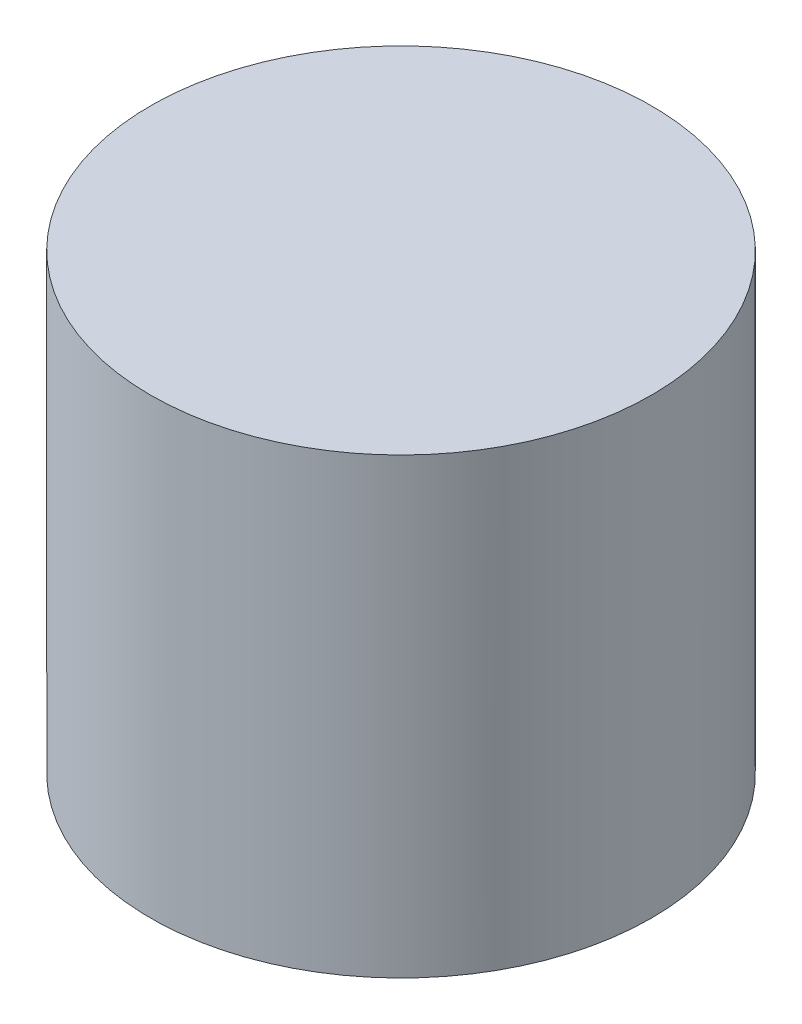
ISO-10303-21;
HEADER;
FILE_DESCRIPTION(('STEP AP214'),'2;1');
FILE_NAME('part.step','',(''),(''),'','','');
FILE_SCHEMA(('AUTOMOTIVE_DESIGN { 1 0 10303 214 1 1 1 1 }'));
ENDSEC;
DATA;
#1=APPLICATION_CONTEXT('core data for automotive mechanical design processes');
#2=APPLICATION_PROTOCOL_DEFINITION('international standard','automotive_design',2000,#1);
#3=PRODUCT_CONTEXT('',#1,'mechanical');
#4=PRODUCT('Part','Part','',(#3));
#5=PRODUCT_RELATED_PRODUCT_CATEGORY('part','',(#4));
#6=PRODUCT_DEFINITION_FORMATION('','',#4);
#7=PRODUCT_DEFINITION_CONTEXT('part definition',#1,'design');
#8=PRODUCT_DEFINITION('design','',#6,#7);
#9=PRODUCT_DEFINITION_SHAPE('','',#8);
#10=(LENGTH_UNIT() NAMED_UNIT(*) SI_UNIT(.MILLI.,.METRE.));
#11=(NAMED_UNIT(*) PLANE_ANGLE_UNIT() SI_UNIT($,.RADIAN.));
#12=(NAMED_UNIT(*) SI_UNIT($,.STERADIAN.) SOLID_ANGLE_UNIT());
#13=UNCERTAINTY_MEASURE_WITH_UNIT(LENGTH_MEASURE(1.E-05),#10,'distance_accuracy_value','');
#14=(GEOMETRIC_REPRESENTATION_CONTEXT(3) GLOBAL_UNCERTAINTY_ASSIGNED_CONTEXT((#13)) GLOBAL_UNIT_ASSIGNED_CONTEXT((#10,
#11,#12)) REPRESENTATION_CONTEXT('',''));
#15=CARTESIAN_POINT('',(0.,0.,0.));
#16=DIRECTION('',(0.,0.,1.));
#17=DIRECTION('',(1.,0.,0.));
#18=AXIS2_PLACEMENT_3D('',#15,#16,#17);
#19=CARTESIAN_POINT('',(0.,57.4,0.));
#20=DIRECTION('',(0.,-1.,0.));
#21=DIRECTION('',(0.,0.,-1.));
#22=AXIS2_PLACEMENT_3D('',#19,#20,#21);
#23=CYLINDRICAL_SURFACE('',#22,31.75);
#24=CARTESIAN_POINT('',(0.,57.4,0.));
#25=DIRECTION('',(0.,1.,0.));
#26=DIRECTION('',(0.,0.,1.));
#27=AXIS2_PLACEMENT_3D('',#24,#25,#26);
#28=CIRCLE('',#27,31.75);
#29=CARTESIAN_POINT('',(0.,57.4,31.75));
#30=VERTEX_POINT('',#29);
#31=EDGE_CURVE('E221',#30,#30,#28,.T.);
#32=ORIENTED_EDGE('',*,*,#31,.F.);
#33=EDGE_LOOP('',(#32));
#34=FACE_BOUND('',#33,.T.);
#35=DIRECTION('',(0.,-1.,0.));
#36=VECTOR('',#35,1.);
#37=CARTESIAN_POINT('',(14.6000295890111,57.4,-28.194));
#38=LINE('',#37,#36);
#39=CARTESIAN_POINT('',(14.6000295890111,21.59,-28.194));
#40=VERTEX_POINT('',#39);
#41=CARTESIAN_POINT('',(14.6000295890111,0.,-28.194));
#42=VERTEX_POINT('',#41);
#43=EDGE_CURVE('E64',#40,#42,#38,.T.);
#44=ORIENTED_EDGE('',*,*,#43,.F.);
#45=CARTESIAN_POINT('',(0.,21.59,0.));
#46=DIRECTION('',(0.,1.,0.));
#47=DIRECTION('',(0.,0.,1.));
#48=AXIS2_PLACEMENT_3D('',#45,#46,#47);
#49=CIRCLE('',#48,31.75);
#50=CARTESIAN_POINT('',(-14.6000295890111,21.59,-28.194));
#51=VERTEX_POINT('',#50);
#52=EDGE_CURVE('E175',#40,#51,#49,.T.);
#53=ORIENTED_EDGE('',*,*,#52,.T.);
#54=DIRECTION('',(0.,-1.,0.));
#55=VECTOR('',#54,1.);
#56=CARTESIAN_POINT('',(-14.6000295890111,57.4,-28.194));
#57=LINE('',#56,#55);
#58=CARTESIAN_POINT('',(-14.6000295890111,0.,-28.194));
#59=VERTEX_POINT('',#58);
#60=EDGE_CURVE('E228',#59,#51,#57,.F.);
#61=ORIENTED_EDGE('',*,*,#60,.F.);
#62=CARTESIAN_POINT('',(0.,0.,0.));
#63=DIRECTION('',(0.,1.,0.));
#64=DIRECTION('',(0.,0.,1.));
#65=AXIS2_PLACEMENT_3D('',#62,#63,#64);
#66=CIRCLE('',#65,31.75);
#67=EDGE_CURVE('E226',#59,#42,#66,.T.);
#68=ORIENTED_EDGE('',*,*,#67,.T.);
#69=EDGE_LOOP('',(#44,#53,#61,#68));
#70=FACE_BOUND('',#69,.T.);
#71=ADVANCED_FACE('F37',(#34,#70),#23,.T.);
#72=CARTESIAN_POINT('',(0.,0.,0.));
#73=DIRECTION('',(0.,1.,0.));
#74=DIRECTION('',(0.,0.,1.));
#75=AXIS2_PLACEMENT_3D('',#72,#73,#74);
#76=PLANE('',#75);
#77=CARTESIAN_POINT('',(-17.5,0.,0.));
#78=DIRECTION('',(0.,-1.,0.));
#79=DIRECTION('',(0.,0.,-1.));
#80=AXIS2_PLACEMENT_3D('',#77,#78,#79);
#81=CIRCLE('',#80,2.5);
#82=CARTESIAN_POINT('',(-17.5,0.,-2.5));
#83=VERTEX_POINT('',#82);
#84=EDGE_CURVE('E116',#83,#83,#81,.T.);
#85=ORIENTED_EDGE('',*,*,#84,.F.);
#86=EDGE_LOOP('',(#85));
#87=FACE_BOUND('',#86,.T.);
#88=CARTESIAN_POINT('',(17.5,0.,0.));
#89=DIRECTION('',(0.,-1.,0.));
#90=DIRECTION('',(0.,0.,-1.));
#91=AXIS2_PLACEMENT_3D('',#88,#89,#90);
#92=CIRCLE('',#91,2.5);
#93=CARTESIAN_POINT('',(17.5,0.,-2.5));
#94=VERTEX_POINT('',#93);
#95=EDGE_CURVE('E115',#94,#94,#92,.T.);
#96=ORIENTED_EDGE('',*,*,#95,.F.);
#97=EDGE_LOOP('',(#96));
#98=FACE_BOUND('',#97,.T.);
#99=CARTESIAN_POINT('',(0.,0.,-17.5));
#100=DIRECTION('',(0.,-1.,0.));
#101=DIRECTION('',(0.,0.,-1.));
#102=AXIS2_PLACEMENT_3D('',#99,#100,#101);
#103=CIRCLE('',#102,2.5);
#104=CARTESIAN_POINT('',(0.,0.,-20.));
#105=VERTEX_POINT('',#104);
#106=EDGE_CURVE('E245',#105,#105,#103,.T.);
#107=ORIENTED_EDGE('',*,*,#106,.F.);
#108=EDGE_LOOP('',(#107));
#109=FACE_BOUND('',#108,.T.);
#110=CARTESIAN_POINT('',(-15.1554445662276,0.,8.75000000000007));
#111=DIRECTION('',(0.,-1.,0.));
#112=DIRECTION('',(0.,0.,-1.));
#113=AXIS2_PLACEMENT_3D('',#110,#111,#112);
#114=CIRCLE('',#113,2.5);
#115=CARTESIAN_POINT('',(-15.1554445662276,0.,6.25000000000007));
#116=VERTEX_POINT('',#115);
#117=EDGE_CURVE('E239',#116,#116,#114,.T.);
#118=ORIENTED_EDGE('',*,*,#117,.F.);
#119=EDGE_LOOP('',(#118));
#120=FACE_BOUND('',#119,.T.);
#121=CARTESIAN_POINT('',(15.1554445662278,0.,8.74999999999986));
#122=DIRECTION('',(0.,-1.,0.));
#123=DIRECTION('',(0.,0.,-1.));
#124=AXIS2_PLACEMENT_3D('',#121,#122,#123);
#125=CIRCLE('',#124,2.5);
#126=CARTESIAN_POINT('',(15.1554445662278,0.,6.24999999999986));
#127=VERTEX_POINT('',#126);
#128=EDGE_CURVE('E231',#127,#127,#125,.T.);
#129=ORIENTED_EDGE('',*,*,#128,.F.);
#130=EDGE_LOOP('',(#129));
#131=FACE_BOUND('',#130,.T.);
#132=DIRECTION('',(-1.,0.,0.));
#133=VECTOR('',#132,1.);
#134=CARTESIAN_POINT('',(0.,0.,-28.194));
#135=LINE('',#134,#133);
#136=EDGE_CURVE('E249',#42,#59,#135,.T.);
#137=ORIENTED_EDGE('',*,*,#136,.F.);
#138=ORIENTED_EDGE('',*,*,#67,.F.);
#139=EDGE_LOOP('',(#137,#138));
#140=FACE_BOUND('',#139,.T.);
#141=ADVANCED_FACE('F211',(#87,#98,#109,#120,#131,#140),#76,.F.);
#142=CARTESIAN_POINT('',(0.,57.4,0.));
#143=DIRECTION('',(0.,1.,0.));
#144=DIRECTION('',(0.,0.,1.));
#145=AXIS2_PLACEMENT_3D('',#142,#143,#144);
#146=PLANE('',#145);
#147=ORIENTED_EDGE('',*,*,#31,.T.);
#148=EDGE_LOOP('',(#147));
#149=FACE_BOUND('',#148,.T.);
#150=ADVANCED_FACE('F216',(#149),#146,.T.);
#151=CARTESIAN_POINT('',(0.,0.,-17.5));
#152=DIRECTION('',(0.,-1.,0.));
#153=DIRECTION('',(0.,0.,-1.));
#154=AXIS2_PLACEMENT_3D('',#151,#152,#153);
#155=CYLINDRICAL_SURFACE('',#154,2.5);
#156=CARTESIAN_POINT('',(0.,12.7,-17.5));
#157=DIRECTION('',(0.,-1.,0.));
#158=DIRECTION('',(0.,0.,-1.));
#159=AXIS2_PLACEMENT_3D('',#156,#157,#158);
#160=CIRCLE('',#159,2.5);
#161=CARTESIAN_POINT('',(0.883727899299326,12.7,-19.8385946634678));
#162=VERTEX_POINT('',#161);
#163=CARTESIAN_POINT('',(-0.883727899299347,12.7,-19.8385946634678));
#164=VERTEX_POINT('',#163);
#165=EDGE_CURVE('E242',#162,#164,#160,.T.);
#166=ORIENTED_EDGE('',*,*,#165,.F.);
#167=CARTESIAN_POINT('',(0.883727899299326,12.7,-19.8385946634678));
#168=CARTESIAN_POINT('',(0.842606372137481,12.6809250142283,-19.8541341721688));
#169=CARTESIAN_POINT('',(0.800595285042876,12.6630545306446,-19.8687684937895));
#170=CARTESIAN_POINT('',(0.71489933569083,12.6298960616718,-19.8960269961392));
#171=CARTESIAN_POINT('',(0.671213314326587,12.6146099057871,-19.9086497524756));
#172=CARTESIAN_POINT('',(0.537797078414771,12.5728974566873,-19.9431935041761));
#173=CARTESIAN_POINT('',(0.445795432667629,12.5506579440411,-19.9617565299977));
#174=CARTESIAN_POINT('',(0.257761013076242,12.5186889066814,-19.9884968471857));
#175=CARTESIAN_POINT('',(0.161712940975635,12.5090122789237,-19.9966302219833));
#176=CARTESIAN_POINT('',(-0.0309609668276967,12.5030234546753,-20.0016598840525));
#177=CARTESIAN_POINT('',(-0.127585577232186,12.5066890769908,-19.9985748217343));
#178=CARTESIAN_POINT('',(-0.313202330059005,12.526502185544,-19.9819603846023));
#179=CARTESIAN_POINT('',(-0.402323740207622,12.5419598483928,-19.9690082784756));
#180=CARTESIAN_POINT('',(-0.576238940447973,12.5836289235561,-19.9342982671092));
#181=CARTESIAN_POINT('',(-0.661032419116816,12.6098411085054,-19.9125397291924));
#182=CARTESIAN_POINT('',(-0.766827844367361,12.6498425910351,-19.8796248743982));
#183=CARTESIAN_POINT('',(-0.790618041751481,12.6593441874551,-19.8718230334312));
#184=CARTESIAN_POINT('',(-0.837604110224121,12.6791066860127,-19.8556385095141));
#185=CARTESIAN_POINT('',(-0.860801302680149,12.6893656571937,-19.8472573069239));
#186=CARTESIAN_POINT('',(-0.883727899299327,12.7,-19.8385946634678));
#187=B_SPLINE_CURVE_WITH_KNOTS('',3,(#167,#168,#169,#170,#171,#172,#173,#174,#175,#176,#177,
#178,#179,#180,#181,#182,#183,#184,#185,#186),.UNSPECIFIED.,.F.,.F.,(4,2,2,2,2,2,2,2,2,4),(0.,
0.143700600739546,0.287502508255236,0.575407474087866,0.864520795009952,1.15315369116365,
1.42608580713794,1.6990375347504,1.77936126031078,1.85948683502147),.UNSPECIFIED.);
#188=EDGE_CURVE('E142',#162,#164,#187,.T.);
#189=ORIENTED_EDGE('',*,*,#188,.T.);
#190=EDGE_LOOP('',(#166,#189));
#191=FACE_BOUND('',#190,.T.);
#192=ORIENTED_EDGE('',*,*,#106,.T.);
#193=EDGE_LOOP('',(#192));
#194=FACE_BOUND('',#193,.T.);
#195=ADVANCED_FACE('F151',(#191,#194),#155,.F.);
#196=CARTESIAN_POINT('',(0.,12.7,-17.5));
#197=DIRECTION('',(0.,-1.,0.));
#198=DIRECTION('',(0.,0.,-1.));
#199=AXIS2_PLACEMENT_3D('',#196,#197,#198);
#200=CONICAL_SURFACE('',#199,2.5,1.02974425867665);
#201=CARTESIAN_POINT('',(0.,14.2021515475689,-17.5));
#202=VERTEX_POINT('',#201);
#203=VERTEX_LOOP('',#202);
#204=FACE_BOUND('',#203,.T.);
#205=CARTESIAN_POINT('',(-0.905817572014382,12.7100349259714,-19.8122));
#206=CARTESIAN_POINT('',(-0.866776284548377,12.7304115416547,-19.7910520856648));
#207=CARTESIAN_POINT('',(-0.827303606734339,12.7504018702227,-19.7702718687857));
#208=CARTESIAN_POINT('',(-0.747053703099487,12.789301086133,-19.729773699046));
#209=CARTESIAN_POINT('',(-0.706271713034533,12.8082051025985,-19.7100605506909));
#210=CARTESIAN_POINT('',(-0.621828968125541,12.8450809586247,-19.6715438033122));
#211=CARTESIAN_POINT('',(-0.5781174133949,12.8629969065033,-19.6527962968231));
#212=CARTESIAN_POINT('',(-0.488884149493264,12.8964068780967,-19.6177780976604));
#213=CARTESIAN_POINT('',(-0.443365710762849,12.9119050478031,-19.6015031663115));
#214=CARTESIAN_POINT('',(-0.346551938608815,12.9405512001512,-19.5713775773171));
#215=CARTESIAN_POINT('',(-0.295081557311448,12.9534267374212,-19.5578096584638));
#216=CARTESIAN_POINT('',(-0.190276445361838,12.97339282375,-19.5367492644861));
#217=CARTESIAN_POINT('',(-0.136966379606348,12.980541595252,-19.5291956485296));
#218=CARTESIAN_POINT('',(-0.0285596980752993,12.9878303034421,-19.521494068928));
#219=CARTESIAN_POINT('',(0.0265511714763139,12.9878772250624,-19.5214443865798));
#220=CARTESIAN_POINT('',(0.135883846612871,12.9807002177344,-19.5290281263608));
#221=CARTESIAN_POINT('',(0.190101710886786,12.9734499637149,-19.5366893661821));
#222=CARTESIAN_POINT('',(0.317142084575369,12.9491900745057,-19.562278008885));
#223=CARTESIAN_POINT('',(0.388807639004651,12.9294490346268,-19.5830732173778));
#224=CARTESIAN_POINT('',(0.52762454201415,12.8832634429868,-19.6315741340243));
#225=CARTESIAN_POINT('',(0.594748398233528,12.8567820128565,-19.6593178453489));
#226=CARTESIAN_POINT('',(0.702581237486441,12.8098904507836,-19.7083027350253));
#227=CARTESIAN_POINT('',(0.744314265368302,12.7905984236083,-19.728422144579));
#228=CARTESIAN_POINT('',(0.826110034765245,12.7510087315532,-19.7696409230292));
#229=CARTESIAN_POINT('',(0.866186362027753,12.7307249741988,-19.7907265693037));
#230=CARTESIAN_POINT('',(0.905817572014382,12.7100349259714,-19.8122));
#231=B_SPLINE_CURVE_WITH_KNOTS('',3,(#205,#206,#207,#208,#209,#210,#211,#212,#213,#214,#215,
#216,#217,#218,#219,#220,#221,#222,#223,#224,#225,#226,#227,#228,#229,#230),.UNSPECIFIED.,.F.,
.F.,(4,2,2,2,2,2,2,2,2,2,2,2,4),(0.,0.146592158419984,0.29379720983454,0.446161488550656,
0.598261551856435,0.762060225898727,0.924171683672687,1.08840618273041,1.25323530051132,
1.48348657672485,1.7150257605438,1.86554324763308,2.01435149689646),.UNSPECIFIED.);
#232=CARTESIAN_POINT('',(-0.905448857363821,12.7102276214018,-19.812));
#233=VERTEX_POINT('',#232);
#234=CARTESIAN_POINT('',(0.90544885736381,12.7102276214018,-19.812));
#235=VERTEX_POINT('',#234);
#236=EDGE_CURVE('E49',#233,#235,#231,.T.);
#237=ORIENTED_EDGE('',*,*,#236,.T.);
#238=CARTESIAN_POINT('',(0.930031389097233,12.7221719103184,-19.7807678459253));
#239=CARTESIAN_POINT('',(0.926876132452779,12.7206135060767,-19.7848553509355));
#240=CARTESIAN_POINT('',(0.923705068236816,12.7190569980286,-19.7889328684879));
#241=CARTESIAN_POINT('',(0.857500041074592,12.6867664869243,-19.8734213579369));
#242=CARTESIAN_POINT('',(0.78825248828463,12.6568506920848,-19.9497818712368));
#243=CARTESIAN_POINT('',(0.680303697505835,12.6179676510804,-20.0475265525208));
#244=CARTESIAN_POINT('',(0.647576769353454,12.6070240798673,-20.0748399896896));
#245=CARTESIAN_POINT('',(0.579547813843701,12.5862402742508,-20.1264296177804));
#246=CARTESIAN_POINT('',(0.544250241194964,12.5763982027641,-20.150710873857));
#247=CARTESIAN_POINT('',(0.465570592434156,12.5568027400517,-20.1988440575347));
#248=CARTESIAN_POINT('',(0.421762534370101,12.5472746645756,-20.2221091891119));
#249=CARTESIAN_POINT('',(0.330620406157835,12.5306652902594,-20.2625232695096));
#250=CARTESIAN_POINT('',(0.283263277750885,12.5236020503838,-20.2796271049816));
#251=CARTESIAN_POINT('',(0.234463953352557,12.518129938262,-20.2928581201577));
#252=B_SPLINE_CURVE_WITH_KNOTS('',3,(#238,#239,#240,#241,#242,#243,#244,#245,#246,#247,#248,
#249,#250,#251),.UNSPECIFIED.,.F.,.F.,(4,2,2,2,2,2,4),(0.,0.0161842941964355,0.336204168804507,
0.468092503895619,0.59975749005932,0.750759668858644,0.902846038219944),.UNSPECIFIED.);
#253=EDGE_CURVE('E11',#235,#162,#252,.T.);
#254=ORIENTED_EDGE('',*,*,#253,.T.);
#255=ORIENTED_EDGE('',*,*,#165,.T.);
#256=CARTESIAN_POINT('',(-0.234463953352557,12.518129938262,-20.2928581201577));
#257=CARTESIAN_POINT('',(-0.283263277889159,12.5236020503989,-20.2796271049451));
#258=CARTESIAN_POINT('',(-0.330620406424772,12.5306652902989,-20.2625232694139));
#259=CARTESIAN_POINT('',(-0.421762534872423,12.5472746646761,-20.2221091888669));
#260=CARTESIAN_POINT('',(-0.465570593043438,12.5568027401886,-20.1988440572));
#261=CARTESIAN_POINT('',(-0.544250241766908,12.5763982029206,-20.1507108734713));
#262=CARTESIAN_POINT('',(-0.579547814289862,12.5862402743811,-20.1264296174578));
#263=CARTESIAN_POINT('',(-0.647576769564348,12.6070240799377,-20.0748399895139));
#264=CARTESIAN_POINT('',(-0.680303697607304,12.6179676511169,-20.047526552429));
#265=CARTESIAN_POINT('',(-0.78825248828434,12.6568506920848,-19.9497818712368));
#266=CARTESIAN_POINT('',(-0.857500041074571,12.6867664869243,-19.8734213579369));
#267=CARTESIAN_POINT('',(-0.923705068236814,12.7190569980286,-19.7889328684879));
#268=CARTESIAN_POINT('',(-0.926876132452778,12.7206135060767,-19.7848553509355));
#269=CARTESIAN_POINT('',(-0.930031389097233,12.7221719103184,-19.7807678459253));
#270=B_SPLINE_CURVE_WITH_KNOTS('',3,(#256,#257,#258,#259,#260,#261,#262,#263,#264,#265,#266,
#267,#268,#269),.UNSPECIFIED.,.F.,.F.,(4,2,2,2,2,2,4),(0.,0.152086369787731,0.303088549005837,
0.43475353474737,0.56664186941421,0.886661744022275,0.902846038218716),.UNSPECIFIED.);
#271=EDGE_CURVE('E169',#164,#233,#270,.T.);
#272=ORIENTED_EDGE('',*,*,#271,.T.);
#273=EDGE_LOOP('',(#237,#254,#255,#272));
#274=FACE_BOUND('',#273,.T.);
#275=ADVANCED_FACE('F180',(#204,#274),#200,.F.);
#276=CARTESIAN_POINT('',(-15.1554445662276,0.,8.75000000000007));
#277=DIRECTION('',(0.,-1.,0.));
#278=DIRECTION('',(0.,0.,-1.));
#279=AXIS2_PLACEMENT_3D('',#276,#277,#278);
#280=CYLINDRICAL_SURFACE('',#279,2.5);
#281=CARTESIAN_POINT('',(-15.1554445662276,12.7,8.75000000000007));
#282=DIRECTION('',(0.,-1.,0.));
#283=DIRECTION('',(0.,0.,-1.));
#284=AXIS2_PLACEMENT_3D('',#281,#282,#283);
#285=CIRCLE('',#284,2.5);
#286=CARTESIAN_POINT('',(-15.1554445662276,12.7,6.25000000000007));
#287=VERTEX_POINT('',#286);
#288=EDGE_CURVE('E236',#287,#287,#285,.T.);
#289=ORIENTED_EDGE('',*,*,#288,.F.);
#290=EDGE_LOOP('',(#289));
#291=FACE_BOUND('',#290,.T.);
#292=ORIENTED_EDGE('',*,*,#117,.T.);
#293=EDGE_LOOP('',(#292));
#294=FACE_BOUND('',#293,.T.);
#295=ADVANCED_FACE('F184',(#291,#294),#280,.F.);
#296=CARTESIAN_POINT('',(-15.1554445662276,12.7,8.75000000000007));
#297=DIRECTION('',(0.,-1.,0.));
#298=DIRECTION('',(0.,0.,-1.));
#299=AXIS2_PLACEMENT_3D('',#296,#297,#298);
#300=CONICAL_SURFACE('',#299,2.5,1.02974425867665);
#301=CARTESIAN_POINT('',(-15.1554445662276,14.2021515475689,8.75000000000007));
#302=VERTEX_POINT('',#301);
#303=VERTEX_LOOP('',#302);
#304=FACE_BOUND('',#303,.T.);
#305=ORIENTED_EDGE('',*,*,#288,.T.);
#306=EDGE_LOOP('',(#305));
#307=FACE_BOUND('',#306,.T.);
#308=ADVANCED_FACE('F190',(#304,#307),#300,.F.);
#309=CARTESIAN_POINT('',(15.1554445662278,0.,8.74999999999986));
#310=DIRECTION('',(0.,-1.,0.));
#311=DIRECTION('',(0.,0.,-1.));
#312=AXIS2_PLACEMENT_3D('',#309,#310,#311);
#313=CYLINDRICAL_SURFACE('',#312,2.5);
#314=CARTESIAN_POINT('',(15.1554445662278,12.7,8.74999999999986));
#315=DIRECTION('',(0.,-1.,0.));
#316=DIRECTION('',(0.,0.,-1.));
#317=AXIS2_PLACEMENT_3D('',#314,#315,#316);
#318=CIRCLE('',#317,2.5);
#319=CARTESIAN_POINT('',(15.1554445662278,12.7,6.24999999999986));
#320=VERTEX_POINT('',#319);
#321=EDGE_CURVE('E227',#320,#320,#318,.T.);
#322=ORIENTED_EDGE('',*,*,#321,.F.);
#323=EDGE_LOOP('',(#322));
#324=FACE_BOUND('',#323,.T.);
#325=ORIENTED_EDGE('',*,*,#128,.T.);
#326=EDGE_LOOP('',(#325));
#327=FACE_BOUND('',#326,.T.);
#328=ADVANCED_FACE('F194',(#324,#327),#313,.F.);
#329=CARTESIAN_POINT('',(15.1554445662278,12.7,8.74999999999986));
#330=DIRECTION('',(0.,-1.,0.));
#331=DIRECTION('',(0.,0.,-1.));
#332=AXIS2_PLACEMENT_3D('',#329,#330,#331);
#333=CONICAL_SURFACE('',#332,2.5,1.02974425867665);
#334=CARTESIAN_POINT('',(15.1554445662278,14.2021515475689,8.74999999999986));
#335=VERTEX_POINT('',#334);
#336=VERTEX_LOOP('',#335);
#337=FACE_BOUND('',#336,.T.);
#338=ORIENTED_EDGE('',*,*,#321,.T.);
#339=EDGE_LOOP('',(#338));
#340=FACE_BOUND('',#339,.T.);
#341=ADVANCED_FACE('F198',(#337,#340),#333,.F.);
#342=CARTESIAN_POINT('',(20.2530517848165,21.59,-31.75));
#343=DIRECTION('',(0.,1.,0.));
#344=DIRECTION('',(0.,0.,1.));
#345=AXIS2_PLACEMENT_3D('',#342,#343,#344);
#346=PLANE('',#345);
#347=DIRECTION('',(-1.,0.,0.));
#348=VECTOR('',#347,1.);
#349=CARTESIAN_POINT('',(20.2530517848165,21.59,-28.194));
#350=LINE('',#349,#348);
#351=EDGE_CURVE('E149',#40,#51,#350,.T.);
#352=ORIENTED_EDGE('',*,*,#351,.T.);
#353=ORIENTED_EDGE('',*,*,#52,.F.);
#354=EDGE_LOOP('',(#352,#353));
#355=FACE_BOUND('',#354,.T.);
#356=ADVANCED_FACE('F201',(#355),#346,.F.);
#357=CARTESIAN_POINT('',(20.2530517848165,0.,-28.194));
#358=DIRECTION('',(0.,0.,-1.));
#359=DIRECTION('',(-1.,0.,0.));
#360=AXIS2_PLACEMENT_3D('',#357,#358,#359);
#361=PLANE('',#360);
#362=CARTESIAN_POINT('',(-8.89,7.62,-28.194));
#363=DIRECTION('',(0.,0.,-1.));
#364=DIRECTION('',(-1.,0.,0.));
#365=AXIS2_PLACEMENT_3D('',#362,#363,#364);
#366=CIRCLE('',#365,2.1);
#367=CARTESIAN_POINT('',(-10.99,7.62,-28.194));
#368=VERTEX_POINT('',#367);
#369=EDGE_CURVE('E129',#368,#368,#366,.T.);
#370=ORIENTED_EDGE('',*,*,#369,.F.);
#371=EDGE_LOOP('',(#370));
#372=FACE_BOUND('',#371,.T.);
#373=CARTESIAN_POINT('',(8.89,7.62,-28.194));
#374=DIRECTION('',(0.,0.,-1.));
#375=DIRECTION('',(-1.,0.,0.));
#376=AXIS2_PLACEMENT_3D('',#373,#374,#375);
#377=CIRCLE('',#376,2.1);
#378=CARTESIAN_POINT('',(6.79,7.62,-28.194));
#379=VERTEX_POINT('',#378);
#380=EDGE_CURVE('E135',#379,#379,#377,.T.);
#381=ORIENTED_EDGE('',*,*,#380,.F.);
#382=EDGE_LOOP('',(#381));
#383=FACE_BOUND('',#382,.T.);
#384=CARTESIAN_POINT('',(0.,14.605,-28.194));
#385=DIRECTION('',(0.,0.,-1.));
#386=DIRECTION('',(-1.,0.,0.));
#387=AXIS2_PLACEMENT_3D('',#384,#385,#386);
#388=CIRCLE('',#387,2.1);
#389=CARTESIAN_POINT('',(-2.1,14.605,-28.194));
#390=VERTEX_POINT('',#389);
#391=EDGE_CURVE('E139',#390,#390,#388,.T.);
#392=ORIENTED_EDGE('',*,*,#391,.F.);
#393=EDGE_LOOP('',(#392));
#394=FACE_BOUND('',#393,.T.);
#395=ORIENTED_EDGE('',*,*,#43,.T.);
#396=ORIENTED_EDGE('',*,*,#136,.T.);
#397=ORIENTED_EDGE('',*,*,#60,.T.);
#398=ORIENTED_EDGE('',*,*,#351,.F.);
#399=EDGE_LOOP('',(#395,#396,#397,#398));
#400=FACE_BOUND('',#399,.T.);
#401=ADVANCED_FACE('F164',(#372,#383,#394,#400),#361,.T.);
#402=CARTESIAN_POINT('',(0.,14.605,-19.812));
#403=DIRECTION('',(0.,0.,-1.));
#404=DIRECTION('',(-1.,0.,0.));
#405=AXIS2_PLACEMENT_3D('',#402,#403,#404);
#406=CONICAL_SURFACE('',#405,2.1,1.02974425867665);
#407=CARTESIAN_POINT('',(0.,14.605,-18.5501927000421));
#408=VERTEX_POINT('',#407);
#409=VERTEX_LOOP('',#408);
#410=FACE_BOUND('',#409,.T.);
#411=CARTESIAN_POINT('',(0.,14.605,-19.812));
#412=DIRECTION('',(0.,0.,-1.));
#413=DIRECTION('',(-1.,0.,0.));
#414=AXIS2_PLACEMENT_3D('',#411,#412,#413);
#415=CIRCLE('',#414,2.1);
#416=EDGE_CURVE('E56',#233,#235,#415,.T.);
#417=ORIENTED_EDGE('',*,*,#416,.T.);
#418=ORIENTED_EDGE('',*,*,#236,.F.);
#419=EDGE_LOOP('',(#417,#418));
#420=FACE_BOUND('',#419,.T.);
#421=ADVANCED_FACE('F160',(#410,#420),#406,.F.);
#422=CARTESIAN_POINT('',(0.,14.605,-28.194));
#423=DIRECTION('',(0.,0.,-1.));
#424=DIRECTION('',(-1.,0.,0.));
#425=AXIS2_PLACEMENT_3D('',#422,#423,#424);
#426=CYLINDRICAL_SURFACE('',#425,2.1);
#427=ORIENTED_EDGE('',*,*,#391,.T.);
#428=EDGE_LOOP('',(#427));
#429=FACE_BOUND('',#428,.T.);
#430=ORIENTED_EDGE('',*,*,#416,.F.);
#431=ORIENTED_EDGE('',*,*,#271,.F.);
#432=ORIENTED_EDGE('',*,*,#188,.F.);
#433=ORIENTED_EDGE('',*,*,#253,.F.);
#434=EDGE_LOOP('',(#430,#431,#432,#433));
#435=FACE_BOUND('',#434,.T.);
#436=ADVANCED_FACE('F154',(#429,#435),#426,.F.);
#437=CARTESIAN_POINT('',(8.89,7.62,-28.194));
#438=DIRECTION('',(0.,0.,-1.));
#439=DIRECTION('',(-1.,0.,0.));
#440=AXIS2_PLACEMENT_3D('',#437,#438,#439);
#441=CYLINDRICAL_SURFACE('',#440,2.1);
#442=CARTESIAN_POINT('',(8.89,7.62,-19.812));
#443=DIRECTION('',(0.,0.,-1.));
#444=DIRECTION('',(-1.,0.,0.));
#445=AXIS2_PLACEMENT_3D('',#442,#443,#444);
#446=CIRCLE('',#445,2.1);
#447=CARTESIAN_POINT('',(6.79,7.62,-19.812));
#448=VERTEX_POINT('',#447);
#449=EDGE_CURVE('E132',#448,#448,#446,.T.);
#450=ORIENTED_EDGE('',*,*,#449,.F.);
#451=EDGE_LOOP('',(#450));
#452=FACE_BOUND('',#451,.T.);
#453=ORIENTED_EDGE('',*,*,#380,.T.);
#454=EDGE_LOOP('',(#453));
#455=FACE_BOUND('',#454,.T.);
#456=ADVANCED_FACE('F159',(#452,#455),#441,.F.);
#457=CARTESIAN_POINT('',(8.89,7.62,-19.812));
#458=DIRECTION('',(0.,0.,-1.));
#459=DIRECTION('',(-1.,0.,0.));
#460=AXIS2_PLACEMENT_3D('',#457,#458,#459);
#461=CONICAL_SURFACE('',#460,2.1,1.02974425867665);
#462=CARTESIAN_POINT('',(8.89,7.62,-18.5501927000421));
#463=VERTEX_POINT('',#462);
#464=VERTEX_LOOP('',#463);
#465=FACE_BOUND('',#464,.T.);
#466=ORIENTED_EDGE('',*,*,#449,.T.);
#467=EDGE_LOOP('',(#466));
#468=FACE_BOUND('',#467,.T.);
#469=ADVANCED_FACE('F289',(#465,#468),#461,.F.);
#470=CARTESIAN_POINT('',(-8.89,7.62,-28.194));
#471=DIRECTION('',(0.,0.,-1.));
#472=DIRECTION('',(-1.,0.,0.));
#473=AXIS2_PLACEMENT_3D('',#470,#471,#472);
#474=CYLINDRICAL_SURFACE('',#473,2.1);
#475=CARTESIAN_POINT('',(-8.89,7.62,-19.812));
#476=DIRECTION('',(0.,0.,-1.));
#477=DIRECTION('',(-1.,0.,0.));
#478=AXIS2_PLACEMENT_3D('',#475,#476,#477);
#479=CIRCLE('',#478,2.1);
#480=CARTESIAN_POINT('',(-10.99,7.62,-19.812));
#481=VERTEX_POINT('',#480);
#482=EDGE_CURVE('E126',#481,#481,#479,.T.);
#483=ORIENTED_EDGE('',*,*,#482,.F.);
#484=EDGE_LOOP('',(#483));
#485=FACE_BOUND('',#484,.T.);
#486=ORIENTED_EDGE('',*,*,#369,.T.);
#487=EDGE_LOOP('',(#486));
#488=FACE_BOUND('',#487,.T.);
#489=ADVANCED_FACE('F297',(#485,#488),#474,.F.);
#490=CARTESIAN_POINT('',(-8.89,7.62,-19.812));
#491=DIRECTION('',(0.,0.,-1.));
#492=DIRECTION('',(-1.,0.,0.));
#493=AXIS2_PLACEMENT_3D('',#490,#491,#492);
#494=CONICAL_SURFACE('',#493,2.1,1.02974425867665);
#495=CARTESIAN_POINT('',(-8.89,7.62,-18.5501927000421));
#496=VERTEX_POINT('',#495);
#497=VERTEX_LOOP('',#496);
#498=FACE_BOUND('',#497,.T.);
#499=ORIENTED_EDGE('',*,*,#482,.T.);
#500=EDGE_LOOP('',(#499));
#501=FACE_BOUND('',#500,.T.);
#502=ADVANCED_FACE('F306',(#498,#501),#494,.F.);
#503=CARTESIAN_POINT('',(17.5,8.,0.));
#504=DIRECTION('',(0.,-1.,0.));
#505=DIRECTION('',(0.,0.,-1.));
#506=AXIS2_PLACEMENT_3D('',#503,#504,#505);
#507=CONICAL_SURFACE('',#506,2.5,1.02974425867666);
#508=CARTESIAN_POINT('',(17.5,9.50215154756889,0.));
#509=VERTEX_POINT('',#508);
#510=VERTEX_LOOP('',#509);
#511=FACE_BOUND('',#510,.T.);
#512=CARTESIAN_POINT('',(17.5,8.,0.));
#513=DIRECTION('',(0.,-1.,0.));
#514=DIRECTION('',(0.,0.,-1.));
#515=AXIS2_PLACEMENT_3D('',#512,#513,#514);
#516=CIRCLE('',#515,2.5);
#517=CARTESIAN_POINT('',(17.5,8.,-2.5));
#518=VERTEX_POINT('',#517);
#519=EDGE_CURVE('E119',#518,#518,#516,.T.);
#520=ORIENTED_EDGE('',*,*,#519,.T.);
#521=EDGE_LOOP('',(#520));
#522=FACE_BOUND('',#521,.T.);
#523=ADVANCED_FACE('F315',(#511,#522),#507,.F.);
#524=CARTESIAN_POINT('',(17.5,0.,0.));
#525=DIRECTION('',(0.,-1.,0.));
#526=DIRECTION('',(0.,0.,-1.));
#527=AXIS2_PLACEMENT_3D('',#524,#525,#526);
#528=CYLINDRICAL_SURFACE('',#527,2.5);
#529=ORIENTED_EDGE('',*,*,#519,.F.);
#530=EDGE_LOOP('',(#529));
#531=FACE_BOUND('',#530,.T.);
#532=ORIENTED_EDGE('',*,*,#95,.T.);
#533=EDGE_LOOP('',(#532));
#534=FACE_BOUND('',#533,.T.);
#535=ADVANCED_FACE('F109',(#531,#534),#528,.F.);
#536=CARTESIAN_POINT('',(-17.5,8.,0.));
#537=DIRECTION('',(0.,-1.,0.));
#538=DIRECTION('',(0.,0.,-1.));
#539=AXIS2_PLACEMENT_3D('',#536,#537,#538);
#540=CONICAL_SURFACE('',#539,2.5,1.02974425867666);
#541=CARTESIAN_POINT('',(-17.5,9.50215154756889,0.));
#542=VERTEX_POINT('',#541);
#543=VERTEX_LOOP('',#542);
#544=FACE_BOUND('',#543,.T.);
#545=CARTESIAN_POINT('',(-17.5,8.,0.));
#546=DIRECTION('',(0.,-1.,0.));
#547=DIRECTION('',(0.,0.,-1.));
#548=AXIS2_PLACEMENT_3D('',#545,#546,#547);
#549=CIRCLE('',#548,2.5);
#550=CARTESIAN_POINT('',(-17.5,8.,-2.5));
#551=VERTEX_POINT('',#550);
#552=EDGE_CURVE('E113',#551,#551,#549,.T.);
#553=ORIENTED_EDGE('',*,*,#552,.T.);
#554=EDGE_LOOP('',(#553));
#555=FACE_BOUND('',#554,.T.);
#556=ADVANCED_FACE('F105',(#544,#555),#540,.F.);
#557=CARTESIAN_POINT('',(-17.5,0.,0.));
#558=DIRECTION('',(0.,-1.,0.));
#559=DIRECTION('',(0.,0.,-1.));
#560=AXIS2_PLACEMENT_3D('',#557,#558,#559);
#561=CYLINDRICAL_SURFACE('',#560,2.5);
#562=ORIENTED_EDGE('',*,*,#552,.F.);
#563=EDGE_LOOP('',(#562));
#564=FACE_BOUND('',#563,.T.);
#565=ORIENTED_EDGE('',*,*,#84,.T.);
#566=EDGE_LOOP('',(#565));
#567=FACE_BOUND('',#566,.T.);
#568=ADVANCED_FACE('F108',(#564,#567),#561,.F.);
#569=CLOSED_SHELL('',(#71,#141,#150,#195,#275,#295,#308,#328,#341,#356,#401,#421,#436,#456,#469,
#489,#502,#523,#535,#556,#568));
#570=MANIFOLD_SOLID_BREP('B2',#569);
#571=ADVANCED_BREP_SHAPE_REPRESENTATION('',(#18,#570),#14);
#572=SHAPE_DEFINITION_REPRESENTATION(#9,#571);
ENDSEC;
END-ISO-10303-21;
